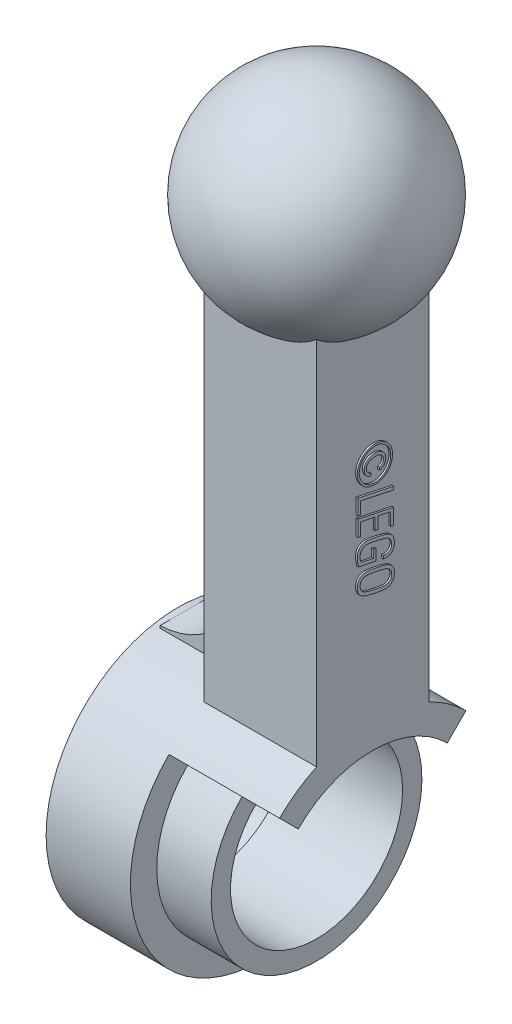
from build123d import *

# Parameters (mm, degrees)
SKETCH1_R                = 3
SKETCH1_R_2              = 2.45
BASE_EXTRUDE_DEPTH       = 3.1
BOSS_EXTRUDE2_DEPTH      = 0.85
BOSS_EXTRUDE2_DEPTH_BACK = 1.55
SKETCH2_R                = 3.75
SKETCH2_R_2              = 3
BOSS_EXTRUDE3_DEPTH      = 1.6
CUT_EXTRUDE1_DEPTH       = 1
BOSS_EXTRUDE5_DEPTH      = 0.7
BOSS_EXTRUDE6_DEPTH      = 0.05


with BuildPart() as part:
    # Sketch1 → Base-Extrude (new body)
    with BuildSketch(Plane(origin=(0, 0, 0), x_dir=(0, 0, -1), z_dir=(1, 0, 0))):
        Circle(SKETCH1_R)
        Circle(SKETCH1_R_2, mode=Mode.SUBTRACT)
    extrude(amount=-BASE_EXTRUDE_DEPTH)

    # Sketch2 → Boss-Extrude2 (add, two sides: drawn at the far end of the back side and taken through both)
    with BuildSketch(Plane.ZY.offset(3.1).offset(-BOSS_EXTRUDE2_DEPTH_BACK)):
        with Locations(Location((0, 0, 0), (0, 0, 135))):
            Circle(SKETCH2_R)
        with Locations(Location((0, 0, 0), (0, 0, 180))):
            Circle(SKETCH2_R_2, mode=Mode.SUBTRACT)
    extrude(amount=BOSS_EXTRUDE2_DEPTH + BOSS_EXTRUDE2_DEPTH_BACK)

    # Sketch3 → Boss-Extrude3 (add, symmetric)
    with BuildSketch(Plane(origin=(0, 0, 0), x_dir=(0, 0, -1), z_dir=(1, 0, 0))):
        with BuildLine():
            Line((1.6, 15.9), (1.6, 3.391533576))
            ThreePointArc((1.6, 3.391533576), (2.157774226, 3.067003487), (2.651650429, 2.651650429))
            Line((2.651650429, 2.651650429), (2.121320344, 2.121320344))
            ThreePointArc((2.121320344, 2.121320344), (0, 3), (-2.121320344, 2.121320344))
            Line((-2.121320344, 2.121320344), (-2.651650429, 2.651650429))
            ThreePointArc((-2.651650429, 2.651650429), (-2.157774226, 3.067003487), (-1.6, 3.391533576))
            Line((-1.6, 3.391533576), (-1.6, 15.9))
            Line((-1.6, 15.9), (1.6, 15.9))
        make_face()
    extrude(amount=BOSS_EXTRUDE3_DEPTH, both=True)

    # Sketch4 → Boss-Revolve1 (revolve)
    with BuildSketch(Plane(origin=(0, 0, 0), x_dir=(0, 0, -1), z_dir=(1, 0, 0))):
        with BuildLine():
            Line((0, 12.9), (0, 18.9))
            ThreePointArc((0, 18.9), (3, 15.9), (0, 12.9))
        make_face()
    revolve(axis=Axis((0, 0, 0), (0, 1, 0)))

    # Sketch5 → Cut-Extrude1 (cut)
    with BuildSketch(Plane.ZY.offset(1.6)):
        with BuildLine():
            Line((0.9, 12), (0.9, 6.5))
            ThreePointArc((0.9, 6.5), (0, 5.6), (-0.9, 6.5))
            Line((-0.9, 6.5), (-0.9, 12))
            ThreePointArc((-0.9, 12), (0, 12.9), (0.9, 12))
        make_face()
    extrude(amount=-CUT_EXTRUDE1_DEPTH, mode=Mode.SUBTRACT)

    # Sketch6 → Boss-Extrude5 (add, symmetric)
    with BuildSketch(Plane.XY):
        with BuildLine():
            Line((-1.6, 5.439096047), (-1.6, 3.533722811))
            Line((-1.6, 3.533722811), (-3.755886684, 3.533722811))
            Line((-3.755886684, 3.533722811), (-3.755886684, 3.75))
            ThreePointArc((-3.755886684, 3.75), (-2.40591661, 4.247345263), (-1.6, 5.439096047))
        make_face()
    extrude(amount=BOSS_EXTRUDE5_DEPTH, both=True)

    # Sketch7 → Boss-Extrude6 (add)
    # profile 1 of 6: a face of its own
    with BuildSketch(Plane(origin=(1.6, 6.296792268, 12.748592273), x_dir=(0, -1, 0), z_dir=(1, 0, 0))):
        with BuildLine():
            add(Edge.make_bspline(
                [(-3.77867941, 13.262648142), (-3.76184862, 13.262143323), (-3.728452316, 13.261141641), (-3.678994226, 13.254210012), (-3.631055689, 13.242016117), (-3.584574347, 13.225583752), (-3.540013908, 13.204618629), (-3.497701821, 13.179328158), (-3.457999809, 13.149541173), (-3.433925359, 13.126715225), (-3.421801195, 13.11521982)],
                knots=[0, 0, 0, 0, 1.018957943, 2.021855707, 3.0162028, 4.009185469, 5.002380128, 5.992645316, 6.989073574, 8, 8, 8, 8], degree=3))
            add(Edge.make_bspline(
                [(-3.421801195, 13.11521982), (-3.410484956, 13.103384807), (-3.387944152, 13.079810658), (-3.359018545, 13.040482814), (-3.333877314, 12.99877261), (-3.313557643, 12.954407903), (-3.297116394, 12.908243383), (-3.285687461, 12.860448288), (-3.278160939, 12.811451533), (-3.277399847, 12.778297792), (-3.277016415, 12.761595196)],
                knots=[0, 0, 0, 0, 1.000946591, 1.993784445, 2.979555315, 3.975955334, 4.974114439, 5.972928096, 6.978776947, 8, 8, 8, 8], degree=3))
            add(Edge.make_bspline(
                [(-3.277016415, 12.761595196), (-3.277417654, 12.744692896), (-3.278209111, 12.711352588), (-3.285358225, 12.662232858), (-3.296938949, 12.614903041), (-3.313043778, 12.56937636), (-3.333598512, 12.525948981), (-3.358661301, 12.484897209), (-3.387661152, 12.445857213), (-3.410343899, 12.422441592), (-3.421801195, 12.410614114)],
                knots=[0, 0, 0, 0, 1.039328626, 2.050107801, 3.04630548, 4.032829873, 5.015822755, 5.996291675, 6.987905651, 8, 8, 8, 8], degree=3))
            add(Edge.make_bspline(
                [(-3.421801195, 12.410614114), (-3.434182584, 12.398961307), (-3.458745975, 12.375843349), (-3.499423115, 12.345992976), (-3.54217821, 12.320025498), (-3.58711679, 12.298463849), (-3.633646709, 12.281555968), (-3.681282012, 12.269609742), (-3.729693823, 12.261919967), (-3.762315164, 12.261002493), (-3.77867941, 12.260542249)],
                knots=[0, 0, 0, 0, 1.026834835, 2.037133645, 3.042569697, 4.046736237, 5.044640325, 6.02933777, 7.011432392, 8, 8, 8, 8], degree=3))
            add(Edge.make_bspline(
                [(-3.77867941, 12.260542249), (-3.795109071, 12.261019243), (-3.827783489, 12.261967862), (-3.87614421, 12.26934977), (-3.923455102, 12.28110937), (-3.969321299, 12.297870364), (-4.013584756, 12.318912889), (-4.0553226, 12.344862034), (-4.095252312, 12.374480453), (-4.119319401, 12.397532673), (-4.131490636, 12.409190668)],
                knots=[0, 0, 0, 0, 1.00281557, 1.994345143, 2.98007901, 3.975109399, 4.971043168, 5.966942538, 6.971839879, 8, 8, 8, 8], degree=3))
            add(Edge.make_bspline(
                [(-4.131490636, 12.409190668), (-4.143078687, 12.421225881), (-4.166091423, 12.445126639), (-4.195614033, 12.484805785), (-4.221131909, 12.526649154), (-4.242227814, 12.570644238), (-4.258754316, 12.616575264), (-4.270569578, 12.663842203), (-4.27764107, 12.712374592), (-4.27862593, 12.745100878), (-4.279122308, 12.761595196)],
                knots=[0, 0, 0, 0, 1.021116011, 2.02783661, 3.017680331, 4.015421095, 5.006948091, 5.998492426, 6.991223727, 8, 8, 8, 8], degree=3))
            add(Edge.make_bspline(
                [(-4.279122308, 12.761595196), (-4.2786372, 12.778023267), (-4.277670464, 12.810761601), (-4.270374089, 12.859292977), (-4.258296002, 12.906834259), (-4.241383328, 12.953120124), (-4.220028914, 12.997836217), (-4.194461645, 13.040529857), (-4.164837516, 13.081112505), (-4.141854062, 13.105683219), (-4.13027054, 13.118066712)],
                knots=[0, 0, 0, 0, 0.994980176, 1.982825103, 2.965844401, 3.962221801, 4.963259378, 5.963294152, 6.973512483, 8, 8, 8, 8], degree=3))
            add(Edge.make_bspline(
                [(-4.13027054, 13.118066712), (-4.11848898, 13.129362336), (-4.095103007, 13.151783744), (-4.056346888, 13.180921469), (-4.015084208, 13.205916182), (-3.971254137, 13.226364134), (-3.925470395, 13.242754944), (-3.877896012, 13.254269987), (-3.82878787, 13.261452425), (-3.795514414, 13.262246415), (-3.77867941, 13.262648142)],
                knots=[0, 0, 0, 0, 1.00234497, 1.989618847, 2.972647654, 3.96216877, 4.956928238, 5.956152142, 6.965896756, 8, 8, 8, 8], degree=3))
        make_face()
        with BuildLine():
            add(Edge.make_bspline(
                [(-3.329073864, 12.761188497), (-3.32944538, 12.776122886), (-3.330183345, 12.805787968), (-3.336695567, 12.849667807), (-3.347301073, 12.892350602), (-3.361979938, 12.933676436), (-3.380464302, 12.973327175), (-3.402670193, 13.010948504), (-3.428851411, 13.046148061), (-3.448777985, 13.067608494), (-3.458810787, 13.078413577)],
                knots=[0, 0, 0, 0, 1.018933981, 2.023970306, 3.020439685, 4.01699499, 5.012615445, 6.002099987, 6.994080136, 8, 8, 8, 8], degree=3))
            add(Edge.make_bspline(
                [(-3.458810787, 13.078413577), (-3.469710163, 13.088834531), (-3.491300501, 13.109477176), (-3.527353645, 13.135844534), (-3.56514504, 13.158828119), (-3.605188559, 13.177441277), (-3.646663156, 13.192417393), (-3.68959778, 13.202953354), (-3.73373989, 13.209495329), (-3.763608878, 13.210223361), (-3.77867941, 13.210590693)],
                knots=[0, 0, 0, 0, 1.017557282, 2.015657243, 3.00970618, 4.001009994, 4.993000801, 5.983500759, 6.982566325, 8, 8, 8, 8], degree=3))
            add(Edge.make_bspline(
                [(-3.77867941, 13.210590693), (-3.793613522, 13.210217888), (-3.823278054, 13.209477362), (-3.867096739, 13.202993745), (-3.9096403, 13.192357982), (-3.950707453, 13.177713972), (-3.989992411, 13.15926727), (-4.026971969, 13.13688376), (-4.061856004, 13.111147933), (-4.082755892, 13.091122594), (-4.093260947, 13.081057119)],
                knots=[0, 0, 0, 0, 1.025734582, 2.03747875, 3.036079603, 4.034897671, 5.028729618, 6.012822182, 7.001171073, 8, 8, 8, 8], degree=3))
            add(Edge.make_bspline(
                [(-4.093260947, 13.081057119), (-4.103638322, 13.069849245), (-4.124189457, 13.047653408), (-4.151163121, 13.011388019), (-4.174221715, 12.973027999), (-4.193329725, 12.932761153), (-4.20834632, 12.891140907), (-4.21928562, 12.848544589), (-4.225666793, 12.805102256), (-4.226598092, 12.775849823), (-4.227064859, 12.761188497)],
                knots=[0, 0, 0, 0, 1.030362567, 2.040508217, 3.044001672, 4.046733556, 5.043824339, 6.025813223, 7.010537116, 8, 8, 8, 8], degree=3))
            add(Edge.make_bspline(
                [(-4.227064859, 12.761188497), (-4.226604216, 12.746526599), (-4.22568935, 12.717407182), (-4.219269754, 12.674169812), (-4.208333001, 12.631939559), (-4.193578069, 12.590684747), (-4.174681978, 12.551001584), (-4.151737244, 12.513488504), (-4.125267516, 12.477979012), (-4.104937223, 12.456448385), (-4.094684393, 12.445590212)],
                knots=[0, 0, 0, 0, 1.001897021, 1.989828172, 2.979668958, 3.97900318, 4.979796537, 5.977647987, 6.980101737, 8, 8, 8, 8], degree=3))
            add(Edge.make_bspline(
                [(-4.094684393, 12.445590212), (-4.08382223, 12.435342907), (-4.062214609, 12.414958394), (-4.026676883, 12.388362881), (-3.989019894, 12.365419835), (-3.949398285, 12.346295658), (-3.9081694, 12.331291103), (-3.865833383, 12.320382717), (-3.822527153, 12.313986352), (-3.793341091, 12.313063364), (-3.77867941, 12.312599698)],
                knots=[0, 0, 0, 0, 1.018033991, 2.025130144, 3.021157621, 4.022120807, 5.021202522, 6.009233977, 6.999934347, 8, 8, 8, 8], degree=3))
            add(Edge.make_bspline(
                [(-3.77867941, 12.312599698), (-3.764013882, 12.313040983), (-3.734743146, 12.313921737), (-3.691288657, 12.320695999), (-3.648536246, 12.331412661), (-3.606852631, 12.346811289), (-3.566516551, 12.366015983), (-3.528083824, 12.389122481), (-3.491839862, 12.415970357), (-3.46986877, 12.436620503), (-3.458810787, 12.447013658)],
                knots=[0, 0, 0, 0, 0.988726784, 1.973386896, 2.95907585, 3.956986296, 4.965064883, 5.967811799, 6.977205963, 8, 8, 8, 8], degree=3))
            add(Edge.make_bspline(
                [(-3.458810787, 12.447013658), (-3.448592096, 12.457572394), (-3.428293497, 12.478546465), (-3.402531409, 12.513666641), (-3.379703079, 12.550360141), (-3.361626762, 12.589540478), (-3.347000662, 12.630338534), (-3.336762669, 12.672741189), (-3.330144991, 12.716514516), (-3.329433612, 12.746184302), (-3.329073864, 12.761188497)],
                knots=[0, 0, 0, 0, 1.008934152, 2.004165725, 2.987050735, 3.975046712, 4.963888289, 5.961734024, 6.969236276, 8, 8, 8, 8], degree=3))
        make_face(mode=Mode.SUBTRACT)
    # profile 2 of 6: a face of its own
    with BuildSketch(Plane(origin=(1.6, 6.296792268, 12.748592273), x_dir=(0, -1, 0), z_dir=(1, 0, 0))):
        with BuildLine():
            add(Edge.make_bspline(
                [(-3.641418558, 12.889908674), (-3.643834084, 12.898358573), (-3.648546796, 12.914844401), (-3.6604336, 12.937177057), (-3.675250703, 12.956805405), (-3.693527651, 12.973029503), (-3.714427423, 12.986249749), (-3.738004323, 12.995591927), (-3.763888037, 13.00145677), (-3.781968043, 13.002053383), (-3.791287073, 13.002360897)],
                knots=[0, 0, 0, 0, 1.034583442, 2.018481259, 2.965600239, 3.922832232, 4.88602793, 5.869340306, 6.901787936, 8, 8, 8, 8], degree=3))
            add(Edge.make_bspline(
                [(-3.791287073, 13.002360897), (-3.798010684, 13.00217847), (-3.811190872, 13.00182086), (-3.830336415, 12.998644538), (-3.848394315, 12.993848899), (-3.865321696, 12.986870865), (-3.88096033, 12.977640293), (-3.895504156, 12.966588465), (-3.908922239, 12.953580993), (-3.920989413, 12.938577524), (-3.931811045, 12.921804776), (-3.941171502, 12.903394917), (-3.949092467, 12.883370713), (-3.955580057, 12.861730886), (-3.960614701, 12.838475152), (-3.964303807, 12.813618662), (-3.966226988, 12.787111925), (-3.966590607, 12.768918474), (-3.966777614, 12.759561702)],
                knots=[0, 0, 0, 0, 0.954364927, 1.870826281, 2.749014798, 3.603666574, 4.462321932, 5.321139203, 6.192652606, 7.109872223, 8.049900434, 9.023020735, 10.038511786, 11.104546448, 12.228195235, 13.415499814, 14.67080855, 16, 16, 16, 16], degree=3))
            add(Edge.make_bspline(
                [(-3.966777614, 12.759561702), (-3.966610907, 12.750609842), (-3.966285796, 12.733151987), (-3.964065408, 12.707667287), (-3.960256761, 12.683592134), (-3.954725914, 12.660973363), (-3.947865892, 12.639706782), (-3.939383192, 12.619900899), (-3.929024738, 12.601705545), (-3.917605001, 12.584789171), (-3.904560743, 12.569787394), (-3.890466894, 12.55657967), (-3.875128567, 12.545555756), (-3.858650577, 12.53654506), (-3.841167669, 12.529314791), (-3.822392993, 12.524560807), (-3.802648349, 12.5213667), (-3.789063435, 12.521010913), (-3.782136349, 12.520829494)],
                knots=[0, 0, 0, 0, 1.263666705, 2.46439412, 3.608060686, 4.701172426, 5.748162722, 6.759612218, 7.736430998, 8.699894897, 9.636077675, 10.536616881, 11.420945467, 12.294596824, 13.183057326, 14.083596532, 15.022806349, 16, 16, 16, 16], degree=3))
            add(Edge.make_bspline(
                [(-3.782136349, 12.520829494), (-3.771938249, 12.521273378), (-3.752083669, 12.522137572), (-3.723410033, 12.528451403), (-3.697140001, 12.539491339), (-3.673347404, 12.554457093), (-3.652747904, 12.573240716), (-3.635824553, 12.595066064), (-3.622850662, 12.619853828), (-3.61790881, 12.637907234), (-3.615389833, 12.647109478)],
                knots=[0, 0, 0, 0, 1.079119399, 2.10092667, 3.088298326, 4.081569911, 5.061799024, 6.023337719, 6.992448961, 8, 8, 8, 8], degree=3))
            Line((-3.615389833, 12.647109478), (-3.550318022, 12.647109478))
            add(Edge.make_bspline(
                [(-3.550318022, 12.647109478), (-3.551125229, 12.640239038), (-3.552721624, 12.626651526), (-3.557550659, 12.606945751), (-3.563731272, 12.58804244), (-3.572180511, 12.57028889), (-3.582450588, 12.553492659), (-3.594466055, 12.537584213), (-3.608383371, 12.522679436), (-3.624042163, 12.508944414), (-3.64092967, 12.496409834), (-3.658995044, 12.485555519), (-3.677985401, 12.476371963), (-3.697997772, 12.468832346), (-3.719026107, 12.462948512), (-3.741047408, 12.458644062), (-3.764051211, 12.456224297), (-3.779690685, 12.455914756), (-3.787626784, 12.455757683)],
                knots=[0, 0, 0, 0, 0.986260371, 1.95050462, 2.889531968, 3.819800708, 4.748761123, 5.694736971, 6.65970864, 7.65334055, 8.66317646, 9.65680837, 10.656120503, 11.66933233, 12.704332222, 13.768524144, 14.867659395, 16, 16, 16, 16], degree=3))
            add(Edge.make_bspline(
                [(-3.787626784, 12.455757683), (-3.797268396, 12.455942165), (-3.816101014, 12.456302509), (-3.84347686, 12.460566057), (-3.869295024, 12.467061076), (-3.893755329, 12.475957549), (-3.91654454, 12.487864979), (-3.937921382, 12.502222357), (-3.957735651, 12.519188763), (-3.975809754, 12.538763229), (-3.991941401, 12.560525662), (-4.006438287, 12.583984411), (-4.018102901, 12.609631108), (-4.027844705, 12.636920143), (-4.035666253, 12.666004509), (-4.041021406, 12.696902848), (-4.04437494, 12.729662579), (-4.044697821, 12.752097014), (-4.044863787, 12.76362869)],
                knots=[0, 0, 0, 0, 1.021960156, 1.996158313, 2.930921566, 3.843207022, 4.750120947, 5.651545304, 6.569508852, 7.510803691, 8.471453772, 9.439502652, 10.430355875, 11.453832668, 12.510809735, 13.620872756, 14.777088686, 16, 16, 16, 16], degree=3))
            add(Edge.make_bspline(
                [(-4.044863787, 12.76362869), (-4.0446027, 12.774887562), (-4.044093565, 12.796843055), (-4.040914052, 12.828893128), (-4.035199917, 12.859157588), (-4.027210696, 12.887692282), (-4.017387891, 12.914707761), (-4.004883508, 12.939813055), (-3.990148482, 12.963172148), (-3.973273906, 12.984655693), (-3.954689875, 13.004245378), (-3.934261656, 13.021106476), (-3.912574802, 13.035546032), (-3.88937861, 13.047137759), (-3.864812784, 13.05643035), (-3.838729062, 13.062817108), (-3.811272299, 13.066822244), (-3.792521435, 13.0672264), (-3.782949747, 13.067432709)],
                knots=[0, 0, 0, 0, 1.196898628, 2.334025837, 3.419361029, 4.466545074, 5.481092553, 6.470377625, 7.441922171, 8.411995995, 9.370087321, 10.306500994, 11.221801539, 12.13374922, 13.057210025, 14.007902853, 14.983101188, 16, 16, 16, 16], degree=3))
            add(Edge.make_bspline(
                [(-3.782949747, 13.067432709), (-3.7756918, 13.067262), (-3.761412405, 13.066926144), (-3.740454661, 13.06471241), (-3.720319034, 13.06082152), (-3.701085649, 13.055327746), (-3.682648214, 13.048469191), (-3.665208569, 13.039769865), (-3.648587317, 13.029662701), (-3.632948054, 13.018073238), (-3.618595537, 13.005343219), (-3.605645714, 12.991662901), (-3.594389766, 12.976945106), (-3.584856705, 12.961235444), (-3.57680549, 12.944736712), (-3.570787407, 12.927213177), (-3.565978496, 12.9089426), (-3.564221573, 12.896304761), (-3.563332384, 12.889908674)],
                knots=[0, 0, 0, 0, 1.121250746, 2.205965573, 3.251297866, 4.285503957, 5.292962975, 6.285785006, 7.291501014, 8.29470614, 9.288687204, 10.251738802, 11.200508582, 12.145166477, 13.086568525, 14.030471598, 15.003209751, 16, 16, 16, 16], degree=3))
            Line((-3.563332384, 12.889908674), (-3.641418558, 12.889908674))
        make_face()
    # profile 3 of 6: a face of its own
    with BuildSketch(Plane(origin=(1.6, 6.296792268, 12.748592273), x_dir=(0, -1, 0), z_dir=(1, 0, 0))):
        Polygon((-3.185915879, 12.273556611), (-2.97178895, 13.288676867), (-2.877638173, 13.288676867), (-3.07854739, 12.351642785), (-2.7304132, 12.351642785), (-2.747087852, 12.273556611), align=None)
    # profile 4 of 6: a face of its own
    with BuildSketch(Plane(origin=(1.6, 6.296792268, 12.748592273), x_dir=(0, -1, 0), z_dir=(1, 0, 0))):
        Polygon((-2.665341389, 12.273556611), (-2.453044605, 13.288676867), (-2.001608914, 13.288676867), (-2.017673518, 13.210590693), (-2.380855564, 13.210590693), (-2.459755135, 12.84618855), (-2.118738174, 12.84618855), (-2.13398938, 12.768102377), (-2.474802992, 12.768102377), (-2.558989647, 12.351642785), (-2.196824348, 12.351642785), (-2.211465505, 12.273556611), align=None)
    # profile 5 of 6: a face of its own
    with BuildSketch(Plane(origin=(1.6, 6.296792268, 12.748592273), x_dir=(0, -1, 0), z_dir=(1, 0, 0))):
        with BuildLine():
            add(Edge.make_bspline(
                [(-1.478187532, 12.291858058), (-1.490246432, 12.289451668), (-1.513726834, 12.284766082), (-1.548101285, 12.278492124), (-1.580681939, 12.272894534), (-1.611469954, 12.2684623), (-1.640415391, 12.264916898), (-1.667482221, 12.262573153), (-1.692627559, 12.260704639), (-1.708782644, 12.260594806), (-1.716513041, 12.260542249)],
                knots=[0, 0, 0, 0, 1.225832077, 2.386870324, 3.483325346, 4.521138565, 5.487527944, 6.389900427, 7.229548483, 8, 8, 8, 8], degree=3))
            add(Edge.make_bspline(
                [(-1.716513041, 12.260542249), (-1.727909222, 12.260707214), (-1.750073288, 12.261028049), (-1.782216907, 12.264370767), (-1.812209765, 12.269576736), (-1.840095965, 12.276837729), (-1.865761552, 12.286413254), (-1.889389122, 12.297955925), (-1.91066103, 12.311950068), (-1.929916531, 12.327822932), (-1.9469222, 12.345861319), (-1.961638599, 12.36595388), (-1.974155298, 12.388031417), (-1.984029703, 12.41229234), (-1.991966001, 12.438352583), (-1.997701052, 12.466458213), (-2.000834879, 12.496559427), (-2.001346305, 12.517297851), (-2.001608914, 12.527946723)],
                knots=[0, 0, 0, 0, 1.222313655, 2.377238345, 3.462882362, 4.486000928, 5.464004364, 6.397432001, 7.301091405, 8.189403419, 9.069130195, 9.953503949, 10.85555242, 11.784749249, 12.757873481, 13.774795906, 14.85739087, 16, 16, 16, 16], degree=3))
            add(Edge.make_bspline(
                [(-2.001608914, 12.527946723), (-2.001410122, 12.535948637), (-2.000976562, 12.553400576), (-1.998599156, 12.58162414), (-1.994675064, 12.614102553), (-1.990084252, 12.643808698), (-1.985949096, 12.670054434), (-1.981939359, 12.691696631), (-1.978048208, 12.714934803), (-1.973185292, 12.739481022), (-1.96844616, 12.765630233), (-1.962872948, 12.793189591), (-1.95700498, 12.822274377), (-1.952882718, 12.842123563), (-1.950771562, 12.852289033)],
                knots=[0, 0, 0, 0, 0.876487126, 1.911592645, 3.100341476, 4.458879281, 5.203351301, 6.010101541, 6.869316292, 7.783654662, 8.750433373, 9.779746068, 10.862929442, 12, 12, 12, 12], degree=3))
            add(Edge.make_bspline(
                [(-1.950771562, 12.852289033), (-1.948550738, 12.862392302), (-1.944240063, 12.882003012), (-1.937677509, 12.910595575), (-1.931386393, 12.937576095), (-1.925390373, 12.962971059), (-1.919212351, 12.986592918), (-1.913299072, 13.008618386), (-1.907677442, 13.029042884), (-1.900506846, 13.053514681), (-1.891648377, 13.081084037), (-1.880698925, 13.110811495), (-1.869953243, 13.136406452), (-1.861810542, 13.151535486), (-1.858044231, 13.158533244)],
                knots=[0, 0, 0, 0, 1.160392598, 2.252352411, 3.290740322, 4.268182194, 5.179221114, 6.029501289, 6.826431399, 7.555467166, 8.890004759, 10.073631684, 11.108980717, 12, 12, 12, 12], degree=3))
            add(Edge.make_bspline(
                [(-1.858044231, 13.158533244), (-1.850236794, 13.171101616), (-1.835013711, 13.195607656), (-1.80719306, 13.227707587), (-1.776718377, 13.254920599), (-1.743089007, 13.277020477), (-1.706129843, 13.29404157), (-1.665910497, 13.306193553), (-1.622211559, 13.313375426), (-1.592023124, 13.314252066), (-1.576405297, 13.314705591)],
                knots=[0, 0, 0, 0, 1.045860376, 2.039237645, 2.994234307, 3.929665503, 4.876250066, 5.864225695, 6.895068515, 8, 8, 8, 8], degree=3))
            add(Edge.make_bspline(
                [(-1.576405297, 13.314705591), (-1.566230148, 13.314519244), (-1.546374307, 13.314155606), (-1.517471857, 13.311075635), (-1.490266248, 13.306008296), (-1.464819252, 13.299015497), (-1.441268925, 13.289697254), (-1.419287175, 13.278843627), (-1.399273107, 13.265427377), (-1.380924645, 13.250238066), (-1.364674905, 13.233124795), (-1.350435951, 13.214401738), (-1.338423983, 13.193998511), (-1.328611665, 13.171889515), (-1.321182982, 13.148184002), (-1.315621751, 13.122958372), (-1.312355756, 13.09605576), (-1.312019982, 13.077541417), (-1.311847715, 13.068042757)],
                knots=[0, 0, 0, 0, 1.187988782, 2.318247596, 3.389450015, 4.41694543, 5.394441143, 6.343149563, 7.273990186, 8.201324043, 9.119525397, 10.023491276, 10.942545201, 11.878052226, 12.841830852, 13.83862194, 14.891119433, 16, 16, 16, 16], degree=3))
            add(Edge.make_bspline(
                [(-1.311847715, 13.068042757), (-1.311963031, 13.064449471), (-1.312228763, 13.056169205), (-1.313224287, 13.042178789), (-1.315431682, 13.02512538), (-1.317064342, 13.012730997), (-1.317948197, 13.006021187)],
                knots=[0, 0, 0, 0, 0.691807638, 1.594182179, 2.69758897, 4, 4, 4, 4], degree=3))
            Line((-1.317948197, 13.006021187), (-1.317948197, 13.002360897))
            Line((-1.317948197, 13.002360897), (-1.407218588, 13.002360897))
            add(Edge.make_bspline(
                [(-1.407218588, 13.002360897), (-1.40648402, 13.007098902), (-1.405092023, 13.016077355), (-1.403955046, 13.029258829), (-1.40301448, 13.041661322), (-1.402970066, 13.049807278), (-1.402948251, 13.053808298)],
                knots=[0, 0, 0, 0, 1.112961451, 2.109046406, 3.071227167, 4, 4, 4, 4], degree=3))
            add(Edge.make_bspline(
                [(-1.402948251, 13.053808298), (-1.403136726, 13.060861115), (-1.403503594, 13.07458943), (-1.405408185, 13.094548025), (-1.40915602, 13.113240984), (-1.414199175, 13.130745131), (-1.420652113, 13.147179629), (-1.428908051, 13.162197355), (-1.438238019, 13.176256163), (-1.449268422, 13.188795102), (-1.461522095, 13.200073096), (-1.475046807, 13.209867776), (-1.489731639, 13.218291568), (-1.505756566, 13.224945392), (-1.522890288, 13.230309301), (-1.541246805, 13.233832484), (-1.560755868, 13.236158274), (-1.574161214, 13.236462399), (-1.581082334, 13.236619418)],
                knots=[0, 0, 0, 0, 1.166547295, 2.270685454, 3.310422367, 4.31425725, 5.280012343, 6.222860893, 7.143051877, 8.064607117, 8.976914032, 9.89162764, 10.820312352, 11.769601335, 12.755186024, 13.783929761, 14.855852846, 16, 16, 16, 16], degree=3))
            add(Edge.make_bspline(
                [(-1.581082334, 13.236619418), (-1.592501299, 13.236270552), (-1.614711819, 13.235591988), (-1.646638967, 13.229146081), (-1.6759463, 13.218761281), (-1.7026322, 13.204115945), (-1.726865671, 13.184940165), (-1.74882531, 13.161211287), (-1.769196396, 13.133115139), (-1.780419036, 13.111985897), (-1.786261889, 13.100985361)],
                knots=[0, 0, 0, 0, 1.048026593, 2.038469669, 2.978039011, 3.894986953, 4.821840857, 5.804264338, 6.85683226, 8, 8, 8, 8], degree=3))
            add(Edge.make_bspline(
                [(-1.786261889, 13.100985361), (-1.78912763, 13.094989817), (-1.795436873, 13.081789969), (-1.80366907, 13.059389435), (-1.81247723, 13.033096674), (-1.819557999, 13.00850475), (-1.825781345, 12.98657155), (-1.830246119, 12.967907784), (-1.835452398, 12.947756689), (-1.840749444, 12.925931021), (-1.846101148, 12.902429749), (-1.852175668, 12.87742183), (-1.857918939, 12.850717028), (-1.862028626, 12.83242521), (-1.864144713, 12.823006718)],
                knots=[0, 0, 0, 0, 0.826735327, 1.820148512, 2.967388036, 4.278160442, 5.00481677, 5.804905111, 6.666383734, 7.595406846, 8.600254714, 9.666453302, 10.798452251, 12, 12, 12, 12], degree=3))
            add(Edge.make_bspline(
                [(-1.864144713, 12.823006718), (-1.866366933, 12.812226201), (-1.870658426, 12.791407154), (-1.877069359, 12.761496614), (-1.882431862, 12.733855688), (-1.887713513, 12.708705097), (-1.891774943, 12.685728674), (-1.895840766, 12.665251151), (-1.898732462, 12.647101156), (-1.902329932, 12.626763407), (-1.905321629, 12.604300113), (-1.908317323, 12.580119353), (-1.910023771, 12.559083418), (-1.910355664, 12.546114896), (-1.910508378, 12.540147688)],
                knots=[0, 0, 0, 0, 1.380724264, 2.666417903, 3.83700122, 4.912538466, 5.889783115, 6.763609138, 7.531013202, 8.194978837, 9.354142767, 10.372930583, 11.251336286, 12, 12, 12, 12], degree=3))
            add(Edge.make_bspline(
                [(-1.910508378, 12.540147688), (-1.91036271, 12.532481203), (-1.910079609, 12.517581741), (-1.907583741, 12.495883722), (-1.903558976, 12.475462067), (-1.897869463, 12.456248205), (-1.890526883, 12.438256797), (-1.881605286, 12.421506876), (-1.870910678, 12.406124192), (-1.858688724, 12.392101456), (-1.845136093, 12.379439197), (-1.83006151, 12.36865423), (-1.81406764, 12.359226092), (-1.796713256, 12.351659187), (-1.77825422, 12.345746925), (-1.758461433, 12.341810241), (-1.737605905, 12.339001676), (-1.723233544, 12.338754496), (-1.715902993, 12.338628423)],
                knots=[0, 0, 0, 0, 1.159097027, 2.25265184, 3.298060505, 4.303502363, 5.27816348, 6.232119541, 7.167667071, 8.105010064, 9.040782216, 9.96554058, 10.902659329, 11.843582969, 12.822654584, 13.827887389, 14.892124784, 16, 16, 16, 16], degree=3))
            add(Edge.make_bspline(
                [(-1.715902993, 12.338628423), (-1.701795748, 12.338854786), (-1.67420972, 12.33929743), (-1.633635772, 12.343004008), (-1.594562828, 12.349341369), (-1.569377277, 12.356044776), (-1.556883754, 12.359370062)],
                knots=[0, 0, 0, 0, 1.052006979, 2.057148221, 3.036230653, 4, 4, 4, 4], degree=3))
            Line((-1.556883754, 12.359370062), (-1.476764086, 12.716044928))
            Line((-1.476764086, 12.716044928), (-1.702278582, 12.716044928))
            Line((-1.702278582, 12.716044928), (-1.685400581, 12.794131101))
            Line((-1.685400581, 12.794131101), (-1.376919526, 12.794131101))
            Line((-1.376919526, 12.794131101), (-1.446465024, 12.445590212))
            add(Edge.make_bspline(
                [(-1.446465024, 12.445590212), (-1.448869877, 12.434955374), (-1.453854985, 12.412910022), (-1.459705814, 12.384549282), (-1.464491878, 12.359911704), (-1.468535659, 12.339084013), (-1.473256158, 12.316195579), (-1.476497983, 12.300196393), (-1.478187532, 12.291858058)],
                knots=[0, 0, 0, 0, 1.25022728, 2.591642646, 3.320264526, 4.128149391, 5.0244431, 6, 6, 6, 6], degree=3))
        make_face()
    # profile 6 of 6: a face of its own
    with BuildSketch(Plane(origin=(1.6, 6.296792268, 12.748592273), x_dir=(0, -1, 0), z_dir=(1, 0, 0))):
        with BuildLine():
            add(Edge.make_bspline(
                [(-1.246775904, 12.522659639), (-1.246597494, 12.53100177), (-1.246202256, 12.549482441), (-1.243315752, 12.579668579), (-1.238729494, 12.614971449), (-1.232581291, 12.655372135), (-1.224897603, 12.700950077), (-1.215109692, 12.751438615), (-1.204558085, 12.807039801), (-1.196354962, 12.845594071), (-1.192074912, 12.865710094)],
                knots=[0, 0, 0, 0, 0.575618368, 1.2751913, 2.090889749, 3.032200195, 4.094896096, 5.28012256, 6.580880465, 8, 8, 8, 8], degree=3))
            add(Edge.make_bspline(
                [(-1.192074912, 12.865710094), (-1.188526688, 12.882546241), (-1.181638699, 12.915229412), (-1.169770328, 12.96236861), (-1.158485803, 13.006576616), (-1.146262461, 13.047046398), (-1.134446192, 13.083340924), (-1.123237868, 13.114540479), (-1.112601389, 13.140290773), (-1.104861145, 13.155119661), (-1.101381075, 13.161786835)],
                knots=[0, 0, 0, 0, 1.329892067, 2.581652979, 3.757237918, 4.856338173, 5.848855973, 6.707462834, 7.418866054, 8, 8, 8, 8], degree=3))
            add(Edge.make_bspline(
                [(-1.101381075, 13.161786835), (-1.097381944, 13.168269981), (-1.089501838, 13.181044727), (-1.076709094, 13.19914113), (-1.06326016, 13.215783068), (-1.049437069, 13.231228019), (-1.034780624, 13.244982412), (-1.019651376, 13.257409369), (-1.004176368, 13.268782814), (-0.982249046, 13.281826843), (-0.952349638, 13.295347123), (-0.912960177, 13.306545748), (-0.869748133, 13.31361238), (-0.839631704, 13.314332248), (-0.82401248, 13.314705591)],
                knots=[0, 0, 0, 0, 0.82075713, 1.617264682, 2.386162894, 3.125665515, 3.849083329, 4.549605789, 5.234880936, 5.916369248, 7.29592212, 8.756850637, 10.318011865, 12, 12, 12, 12], degree=3))
            add(Edge.make_bspline(
                [(-0.82401248, 13.314705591), (-0.813496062, 13.314544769), (-0.793087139, 13.314232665), (-0.76345417, 13.310839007), (-0.735657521, 13.305692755), (-0.709781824, 13.298167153), (-0.685807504, 13.288561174), (-0.663670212, 13.277021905), (-0.643557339, 13.263039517), (-0.625469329, 13.246934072), (-0.609238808, 13.228907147), (-0.595157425, 13.208912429), (-0.583390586, 13.186939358), (-0.573433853, 13.163245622), (-0.566377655, 13.137417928), (-0.560781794, 13.109929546), (-0.557514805, 13.080457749), (-0.557184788, 13.060187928), (-0.557014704, 13.04974131)],
                knots=[0, 0, 0, 0, 1.175277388, 2.280828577, 3.330169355, 4.332652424, 5.288203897, 6.213680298, 7.11765186, 8.019524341, 8.915743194, 9.824056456, 10.746424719, 11.697819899, 12.690920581, 13.734278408, 14.832297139, 16, 16, 16, 16], degree=3))
            add(Edge.make_bspline(
                [(-0.557014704, 13.04974131), (-0.557207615, 13.042009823), (-0.557626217, 13.025233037), (-0.560110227, 12.997976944), (-0.563684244, 12.966630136), (-0.568124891, 12.937797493), (-0.572345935, 12.912335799), (-0.575988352, 12.890832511), (-0.580325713, 12.867539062), (-0.584922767, 12.84229558), (-0.590279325, 12.815343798), (-0.595941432, 12.786515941), (-0.602292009, 12.755900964), (-0.606634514, 12.734821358), (-0.608868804, 12.723975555)],
                knots=[0, 0, 0, 0, 0.842807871, 1.828834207, 2.981748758, 4.28162173, 5.007991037, 5.795100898, 6.658829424, 7.590630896, 8.591902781, 9.654024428, 10.792957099, 12, 12, 12, 12], degree=3))
            add(Edge.make_bspline(
                [(-0.608868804, 12.723975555), (-0.611240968, 12.713130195), (-0.615837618, 12.692114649), (-0.622532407, 12.661525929), (-0.628974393, 12.632972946), (-0.635339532, 12.606415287), (-0.641358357, 12.581923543), (-0.64729666, 12.559427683), (-0.652999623, 12.53897723), (-0.659818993, 12.514893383), (-0.66815983, 12.488030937), (-0.67880013, 12.459214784), (-0.689289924, 12.434265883), (-0.697414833, 12.419505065), (-0.701189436, 12.412647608)],
                knots=[0, 0, 0, 0, 1.226824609, 2.37727363, 3.460296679, 4.461369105, 5.395165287, 6.247276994, 7.032354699, 7.741269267, 9.013447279, 10.139147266, 11.135500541, 12, 12, 12, 12], degree=3))
            add(Edge.make_bspline(
                [(-0.701189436, 12.412647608), (-0.70489134, 12.406283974), (-0.712169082, 12.393773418), (-0.724583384, 12.376240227), (-0.737386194, 12.359801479), (-0.751247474, 12.344838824), (-0.765558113, 12.331019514), (-0.780731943, 12.318527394), (-0.796633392, 12.307305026), (-0.813360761, 12.297322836), (-0.830945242, 12.288505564), (-0.849462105, 12.281032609), (-0.868883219, 12.274671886), (-0.889297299, 12.269651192), (-0.910682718, 12.265614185), (-0.933061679, 12.262460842), (-0.956439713, 12.260954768), (-0.972320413, 12.260681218), (-0.980388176, 12.260542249)],
                knots=[0, 0, 0, 0, 1.052351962, 2.068866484, 3.069589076, 4.030112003, 4.98312133, 5.91277099, 6.837962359, 7.763965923, 8.696038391, 9.648307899, 10.617013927, 11.616232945, 12.652386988, 13.728578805, 14.84606553, 16, 16, 16, 16], degree=3))
            add(Edge.make_bspline(
                [(-0.980388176, 12.260542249), (-0.990700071, 12.260711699), (-1.010768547, 12.261041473), (-1.039958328, 12.264338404), (-1.067305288, 12.269805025), (-1.092896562, 12.277359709), (-1.116820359, 12.286846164), (-1.138945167, 12.298693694), (-1.159147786, 12.312826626), (-1.17758283, 12.328910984), (-1.193862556, 12.347145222), (-1.208195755, 12.367042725), (-1.219974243, 12.388861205), (-1.2298029, 12.412211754), (-1.237555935, 12.437334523), (-1.242949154, 12.464244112), (-1.24628434, 12.49288619), (-1.246608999, 12.512550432), (-1.246775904, 12.522659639)],
                knots=[0, 0, 0, 0, 1.16414172, 2.265592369, 3.311935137, 4.309808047, 5.274966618, 6.213345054, 7.137059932, 8.05373864, 8.969777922, 9.891651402, 10.816570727, 11.763403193, 12.74883821, 13.780177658, 14.858809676, 16, 16, 16, 16], degree=3))
        make_face()
        with BuildLine():
            add(Edge.make_bspline(
                [(-0.829909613, 13.236619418), (-0.841529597, 13.236335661), (-0.863916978, 13.235788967), (-0.895793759, 13.229749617), (-0.924541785, 13.220299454), (-0.95029623, 13.206583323), (-0.973389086, 13.188030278), (-0.994640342, 13.164644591), (-1.014407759, 13.136139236), (-1.025571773, 13.114682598), (-1.031428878, 13.103425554)],
                knots=[0, 0, 0, 0, 1.080335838, 2.08140476, 3.007134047, 3.887802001, 4.781481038, 5.750383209, 6.819757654, 8, 8, 8, 8], degree=3))
            add(Edge.make_bspline(
                [(-1.031428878, 13.103425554), (-1.033868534, 13.098098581), (-1.03947074, 13.085866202), (-1.047112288, 13.064527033), (-1.055706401, 13.038165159), (-1.064591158, 13.007048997), (-1.07407085, 12.971931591), (-1.083814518, 12.933573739), (-1.093601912, 12.892225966), (-1.099802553, 12.863619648), (-1.103007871, 12.848832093)],
                knots=[0, 0, 0, 0, 0.530694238, 1.218638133, 2.051874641, 3.043172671, 4.150157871, 5.347821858, 6.629001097, 8, 8, 8, 8], degree=3))
            add(Edge.make_bspline(
                [(-1.103007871, 12.848832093), (-1.105327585, 12.837650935), (-1.109810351, 12.816043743), (-1.116083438, 12.784572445), (-1.12205535, 12.755182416), (-1.127220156, 12.727761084), (-1.132258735, 12.702452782), (-1.13638245, 12.67916323), (-1.14039075, 12.657916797), (-1.14448701, 12.633099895), (-1.148935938, 12.605630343), (-1.152563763, 12.576256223), (-1.155020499, 12.551507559), (-1.155473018, 12.536491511), (-1.155675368, 12.529776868)],
                knots=[0, 0, 0, 0, 1.269945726, 2.454125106, 3.568819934, 4.605187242, 5.557279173, 6.438514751, 7.235470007, 7.961690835, 9.235746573, 10.329704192, 11.25310301, 12, 12, 12, 12], degree=3))
            add(Edge.make_bspline(
                [(-1.155675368, 12.529776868), (-1.155509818, 12.522450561), (-1.155185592, 12.508102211), (-1.152936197, 12.487228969), (-1.149323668, 12.467631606), (-1.14422959, 12.449292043), (-1.137555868, 12.432253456), (-1.129358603, 12.416449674), (-1.119752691, 12.401925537), (-1.108762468, 12.388643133), (-1.096350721, 12.376812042), (-1.082561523, 12.366622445), (-1.067733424, 12.357744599), (-1.051447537, 12.350900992), (-1.034147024, 12.345452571), (-1.015674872, 12.341241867), (-0.99589172, 12.339142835), (-0.982290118, 12.338802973), (-0.975304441, 12.338628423)],
                knots=[0, 0, 0, 0, 1.177093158, 2.305301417, 3.369110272, 4.375974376, 5.358932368, 6.303989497, 7.231370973, 8.151754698, 9.068522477, 9.979058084, 10.901823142, 11.838559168, 12.809923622, 13.814074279, 14.877325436, 16, 16, 16, 16], degree=3))
            add(Edge.make_bspline(
                [(-0.975304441, 12.338628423), (-0.96388799, 12.338996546), (-0.941907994, 12.339705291), (-0.910356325, 12.345754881), (-0.881630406, 12.355400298), (-0.85550633, 12.36932273), (-0.831899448, 12.387938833), (-0.810345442, 12.411215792), (-0.790454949, 12.439108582), (-0.779495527, 12.460081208), (-0.773785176, 12.471008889)],
                knots=[0, 0, 0, 0, 1.066706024, 2.053720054, 2.991776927, 3.890687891, 4.807366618, 5.789382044, 6.848168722, 8, 8, 8, 8], degree=3))
            add(Edge.make_bspline(
                [(-0.773785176, 12.471008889), (-0.771080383, 12.477151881), (-0.765142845, 12.490636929), (-0.756922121, 12.513174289), (-0.748698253, 12.539773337), (-0.739865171, 12.570616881), (-0.730478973, 12.606407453), (-0.720620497, 12.647734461), (-0.70982983, 12.694707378), (-0.702578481, 12.727967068), (-0.698749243, 12.745530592)],
                knots=[0, 0, 0, 0, 0.565071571, 1.240440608, 2.018442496, 2.909050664, 3.941793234, 5.133691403, 6.486381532, 8, 8, 8, 8], degree=3))
            add(Edge.make_bspline(
                [(-0.698749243, 12.745530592), (-0.696366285, 12.756576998), (-0.691763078, 12.777915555), (-0.685286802, 12.808763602), (-0.679353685, 12.837293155), (-0.674069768, 12.863526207), (-0.669376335, 12.887451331), (-0.66538643, 12.909101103), (-0.661559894, 12.928365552), (-0.65802071, 12.950497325), (-0.653979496, 12.974838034), (-0.65084177, 13.001034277), (-0.648513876, 13.023467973), (-0.648239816, 13.0371969), (-0.64811524, 13.043437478)],
                knots=[0, 0, 0, 0, 1.344629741, 2.597447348, 3.750577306, 4.811939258, 5.781569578, 6.65158919, 7.431436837, 8.118277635, 9.318319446, 10.366731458, 11.257586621, 12, 12, 12, 12], degree=3))
            add(Edge.make_bspline(
                [(-0.64811524, 13.043437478), (-0.648308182, 13.050963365), (-0.648682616, 13.06556846), (-0.650522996, 13.086904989), (-0.654568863, 13.106763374), (-0.659436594, 13.125453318), (-0.666355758, 13.142561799), (-0.674149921, 13.15870916), (-0.684021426, 13.173224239), (-0.695015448, 13.186613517), (-0.707447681, 13.19842578), (-0.72125755, 13.208691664), (-0.736228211, 13.217442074), (-0.752595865, 13.224394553), (-0.770117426, 13.22981724), (-0.788933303, 13.234002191), (-0.809052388, 13.23609756), (-0.822856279, 13.23644294), (-0.829909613, 13.236619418)],
                knots=[0, 0, 0, 0, 1.196268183, 2.321535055, 3.396668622, 4.413069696, 5.38507652, 6.324309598, 7.256289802, 8.1664195, 9.072973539, 9.973364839, 10.895145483, 11.821445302, 12.792258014, 13.806259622, 14.879071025, 16, 16, 16, 16], degree=3))
        make_face(mode=Mode.SUBTRACT)
    extrude(amount=BOSS_EXTRUDE6_DEPTH)


solid = part.part
